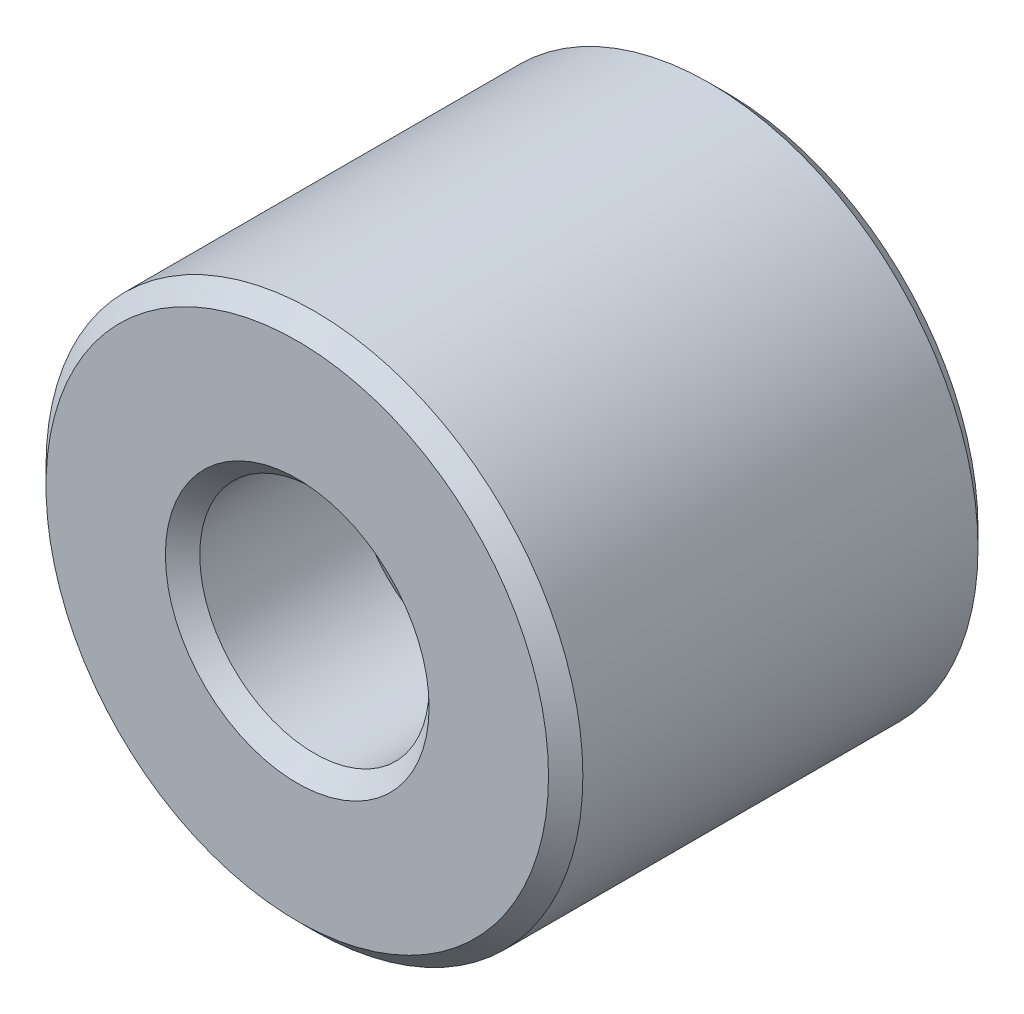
ISO-10303-21;
HEADER;
FILE_DESCRIPTION(('STEP AP214'),'2;1');
FILE_NAME('part.step','',(''),(''),'','','');
FILE_SCHEMA(('AUTOMOTIVE_DESIGN { 1 0 10303 214 1 1 1 1 }'));
ENDSEC;
DATA;
#1=APPLICATION_CONTEXT('core data for automotive mechanical design processes');
#2=APPLICATION_PROTOCOL_DEFINITION('international standard','automotive_design',2000,#1);
#3=PRODUCT_CONTEXT('',#1,'mechanical');
#4=PRODUCT('Part','Part','',(#3));
#5=PRODUCT_RELATED_PRODUCT_CATEGORY('part','',(#4));
#6=PRODUCT_DEFINITION_FORMATION('','',#4);
#7=PRODUCT_DEFINITION_CONTEXT('part definition',#1,'design');
#8=PRODUCT_DEFINITION('design','',#6,#7);
#9=PRODUCT_DEFINITION_SHAPE('','',#8);
#10=(LENGTH_UNIT() NAMED_UNIT(*) SI_UNIT(.MILLI.,.METRE.));
#11=(NAMED_UNIT(*) PLANE_ANGLE_UNIT() SI_UNIT($,.RADIAN.));
#12=(NAMED_UNIT(*) SI_UNIT($,.STERADIAN.) SOLID_ANGLE_UNIT());
#13=UNCERTAINTY_MEASURE_WITH_UNIT(LENGTH_MEASURE(1.E-05),#10,'distance_accuracy_value','');
#14=(GEOMETRIC_REPRESENTATION_CONTEXT(3) GLOBAL_UNCERTAINTY_ASSIGNED_CONTEXT((#13)) GLOBAL_UNIT_ASSIGNED_CONTEXT((#10,
#11,#12)) REPRESENTATION_CONTEXT('',''));
#15=CARTESIAN_POINT('',(0.,0.,0.));
#16=DIRECTION('',(0.,0.,1.));
#17=DIRECTION('',(1.,0.,0.));
#18=AXIS2_PLACEMENT_3D('',#15,#16,#17);
#19=CARTESIAN_POINT('',(0.,4.9022,-2.413));
#20=DIRECTION('',(0.,0.,1.));
#21=DIRECTION('',(0.,1.,0.));
#22=AXIS2_PLACEMENT_3D('',#19,#20,#21);
#23=PLANE('',#22);
#24=CARTESIAN_POINT('',(0.,0.,-2.413));
#25=DIRECTION('',(0.,0.,-1.));
#26=DIRECTION('',(-1.,0.,0.));
#27=AXIS2_PLACEMENT_3D('',#24,#25,#26);
#28=CIRCLE('',#27,3.8989);
#29=CARTESIAN_POINT('',(-3.89890000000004,0.,-2.41300000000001));
#30=VERTEX_POINT('',#29);
#31=EDGE_CURVE('E165',#30,#30,#28,.T.);
#32=ORIENTED_EDGE('',*,*,#31,.F.);
#33=EDGE_LOOP('',(#32));
#34=FACE_BOUND('',#33,.T.);
#35=CARTESIAN_POINT('',(0.,0.,-2.413));
#36=DIRECTION('',(0.,0.,-1.));
#37=DIRECTION('',(-1.,0.,0.));
#38=AXIS2_PLACEMENT_3D('',#35,#36,#37);
#39=CIRCLE('',#38,4.9022);
#40=CARTESIAN_POINT('',(-4.90220000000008,0.,-2.41300000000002));
#41=VERTEX_POINT('',#40);
#42=EDGE_CURVE('E151',#41,#41,#39,.T.);
#43=ORIENTED_EDGE('',*,*,#42,.T.);
#44=EDGE_LOOP('',(#43));
#45=FACE_BOUND('',#44,.T.);
#46=ADVANCED_FACE('F56',(#34,#45),#23,.F.);
#47=CARTESIAN_POINT('',(0.,7.42950000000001,-9.525));
#48=DIRECTION('',(0.,0.,1.));
#49=DIRECTION('',(0.,1.,0.));
#50=AXIS2_PLACEMENT_3D('',#47,#48,#49);
#51=PLANE('',#50);
#52=CARTESIAN_POINT('',(0.,0.,-9.525));
#53=DIRECTION('',(0.,0.,-1.));
#54=DIRECTION('',(-1.,0.,0.));
#55=AXIS2_PLACEMENT_3D('',#52,#53,#54);
#56=CIRCLE('',#55,5.6642);
#57=CARTESIAN_POINT('',(-5.66420000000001,0.,-9.52500000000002));
#58=VERTEX_POINT('',#57);
#59=EDGE_CURVE('E144',#58,#58,#56,.T.);
#60=ORIENTED_EDGE('',*,*,#59,.F.);
#61=EDGE_LOOP('',(#60));
#62=FACE_BOUND('',#61,.T.);
#63=CARTESIAN_POINT('',(0.,0.,-9.525));
#64=DIRECTION('',(0.,0.,-1.));
#65=DIRECTION('',(-1.,0.,0.));
#66=AXIS2_PLACEMENT_3D('',#63,#64,#65);
#67=CIRCLE('',#66,7.4295);
#68=CARTESIAN_POINT('',(7.4295000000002,0.,-9.52499999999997));
#69=VERTEX_POINT('',#68);
#70=EDGE_CURVE('E118',#69,#69,#67,.T.);
#71=ORIENTED_EDGE('',*,*,#70,.T.);
#72=EDGE_LOOP('',(#71));
#73=FACE_BOUND('',#72,.T.);
#74=ADVANCED_FACE('F195',(#62,#73),#51,.F.);
#75=CARTESIAN_POINT('',(0.,3.89890000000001,3.175));
#76=DIRECTION('',(0.,0.,-1.));
#77=DIRECTION('',(-1.,0.,0.));
#78=AXIS2_PLACEMENT_3D('',#75,#76,#77);
#79=PLANE('',#78);
#80=CARTESIAN_POINT('',(0.,0.,3.175));
#81=DIRECTION('',(0.,0.,-1.));
#82=DIRECTION('',(-1.,0.,0.));
#83=AXIS2_PLACEMENT_3D('',#80,#81,#82);
#84=CIRCLE('',#83,3.8989);
#85=CARTESIAN_POINT('',(3.89890000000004,0.,3.17500000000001));
#86=VERTEX_POINT('',#85);
#87=EDGE_CURVE('E12',#86,#86,#84,.T.);
#88=ORIENTED_EDGE('',*,*,#87,.T.);
#89=EDGE_LOOP('',(#88));
#90=FACE_BOUND('',#89,.T.);
#91=CARTESIAN_POINT('',(0.,0.,3.175));
#92=DIRECTION('',(0.,0.,-1.));
#93=DIRECTION('',(-1.,0.,0.));
#94=AXIS2_PLACEMENT_3D('',#91,#92,#93);
#95=CIRCLE('',#94,7.4295);
#96=CARTESIAN_POINT('',(7.42949999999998,0.,3.17500000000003));
#97=VERTEX_POINT('',#96);
#98=EDGE_CURVE('E67',#97,#97,#95,.T.);
#99=ORIENTED_EDGE('',*,*,#98,.F.);
#100=EDGE_LOOP('',(#99));
#101=FACE_BOUND('',#100,.T.);
#102=ADVANCED_FACE('F201',(#90,#101),#79,.F.);
#103=CARTESIAN_POINT('',(0.,0.,2.667));
#104=DIRECTION('',(0.,0.,1.));
#105=DIRECTION('',(1.,0.,0.));
#106=AXIS2_PLACEMENT_3D('',#103,#104,#105);
#107=CONICAL_SURFACE('',#106,3.3909,0.785398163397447);
#108=ORIENTED_EDGE('',*,*,#87,.F.);
#109=EDGE_LOOP('',(#108));
#110=FACE_BOUND('',#109,.T.);
#111=CARTESIAN_POINT('',(0.,0.,2.667));
#112=DIRECTION('',(0.,0.,-1.));
#113=DIRECTION('',(-1.,0.,0.));
#114=AXIS2_PLACEMENT_3D('',#111,#112,#113);
#115=CIRCLE('',#114,3.3909);
#116=CARTESIAN_POINT('',(-3.39089999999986,0.,2.66699999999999));
#117=VERTEX_POINT('',#116);
#118=EDGE_CURVE('E90',#117,#117,#115,.T.);
#119=ORIENTED_EDGE('',*,*,#118,.T.);
#120=EDGE_LOOP('',(#119));
#121=FACE_BOUND('',#120,.T.);
#122=ADVANCED_FACE('F220',(#110,#121),#107,.F.);
#123=CARTESIAN_POINT('',(0.,0.,3.175));
#124=DIRECTION('',(0.,0.,-1.));
#125=DIRECTION('',(-1.,0.,0.));
#126=AXIS2_PLACEMENT_3D('',#123,#124,#125);
#127=CONICAL_SURFACE('',#126,7.4295,0.785398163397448);
#128=CARTESIAN_POINT('',(0.,0.,2.667));
#129=DIRECTION('',(0.,0.,-1.));
#130=DIRECTION('',(-1.,0.,0.));
#131=AXIS2_PLACEMENT_3D('',#128,#129,#130);
#132=CIRCLE('',#131,7.9375);
#133=CARTESIAN_POINT('',(7.93750000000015,0.,2.66700000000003));
#134=VERTEX_POINT('',#133);
#135=EDGE_CURVE('E60',#134,#134,#132,.T.);
#136=ORIENTED_EDGE('',*,*,#135,.F.);
#137=EDGE_LOOP('',(#136));
#138=FACE_BOUND('',#137,.T.);
#139=ORIENTED_EDGE('',*,*,#98,.T.);
#140=EDGE_LOOP('',(#139));
#141=FACE_BOUND('',#140,.T.);
#142=ADVANCED_FACE('F58',(#138,#141),#127,.T.);
#143=CARTESIAN_POINT('',(0.,0.,-16.0333864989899));
#144=DIRECTION('',(0.,0.,-1.));
#145=DIRECTION('',(-1.,0.,0.));
#146=AXIS2_PLACEMENT_3D('',#143,#144,#145);
#147=CYLINDRICAL_SURFACE('',#146,7.9375);
#148=CARTESIAN_POINT('',(0.,0.,-9.017));
#149=DIRECTION('',(0.,0.,-1.));
#150=DIRECTION('',(-1.,0.,0.));
#151=AXIS2_PLACEMENT_3D('',#148,#149,#150);
#152=CIRCLE('',#151,7.9375);
#153=CARTESIAN_POINT('',(7.93750000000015,0.,-9.01699999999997));
#154=VERTEX_POINT('',#153);
#155=EDGE_CURVE('E127',#154,#154,#152,.T.);
#156=ORIENTED_EDGE('',*,*,#155,.F.);
#157=EDGE_LOOP('',(#156));
#158=FACE_BOUND('',#157,.T.);
#159=ORIENTED_EDGE('',*,*,#135,.T.);
#160=EDGE_LOOP('',(#159));
#161=FACE_BOUND('',#160,.T.);
#162=ADVANCED_FACE('F205',(#158,#161),#147,.T.);
#163=CARTESIAN_POINT('',(0.,0.,-9.017));
#164=DIRECTION('',(0.,0.,1.));
#165=DIRECTION('',(1.,0.,0.));
#166=AXIS2_PLACEMENT_3D('',#163,#164,#165);
#167=CONICAL_SURFACE('',#166,7.9375,0.78539816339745);
#168=ORIENTED_EDGE('',*,*,#155,.T.);
#169=EDGE_LOOP('',(#168));
#170=FACE_BOUND('',#169,.T.);
#171=ORIENTED_EDGE('',*,*,#70,.F.);
#172=EDGE_LOOP('',(#171));
#173=FACE_BOUND('',#172,.T.);
#174=ADVANCED_FACE('F207',(#170,#173),#167,.T.);
#175=CARTESIAN_POINT('',(0.,0.,-9.525));
#176=DIRECTION('',(0.,0.,-1.));
#177=DIRECTION('',(-1.,0.,0.));
#178=AXIS2_PLACEMENT_3D('',#175,#176,#177);
#179=CONICAL_SURFACE('',#178,5.6642,0.78539816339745);
#180=ORIENTED_EDGE('',*,*,#59,.T.);
#181=EDGE_LOOP('',(#180));
#182=FACE_BOUND('',#181,.T.);
#183=CARTESIAN_POINT('',(0.,0.,-9.017));
#184=DIRECTION('',(0.,0.,-1.));
#185=DIRECTION('',(-1.,0.,0.));
#186=AXIS2_PLACEMENT_3D('',#183,#184,#185);
#187=CIRCLE('',#186,5.1562);
#188=CARTESIAN_POINT('',(-5.15620000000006,0.,-9.01700000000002));
#189=VERTEX_POINT('',#188);
#190=EDGE_CURVE('E139',#189,#189,#187,.T.);
#191=ORIENTED_EDGE('',*,*,#190,.F.);
#192=EDGE_LOOP('',(#191));
#193=FACE_BOUND('',#192,.T.);
#194=ADVANCED_FACE('F190',(#182,#193),#179,.F.);
#195=CARTESIAN_POINT('',(0.,0.,-16.0333864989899));
#196=DIRECTION('',(0.,0.,-1.));
#197=DIRECTION('',(-1.,0.,0.));
#198=AXIS2_PLACEMENT_3D('',#195,#196,#197);
#199=CYLINDRICAL_SURFACE('',#198,5.1562);
#200=ORIENTED_EDGE('',*,*,#190,.T.);
#201=EDGE_LOOP('',(#200));
#202=FACE_BOUND('',#201,.T.);
#203=CARTESIAN_POINT('',(0.,0.,-2.667));
#204=DIRECTION('',(0.,0.,-1.));
#205=DIRECTION('',(-1.,0.,0.));
#206=AXIS2_PLACEMENT_3D('',#203,#204,#205);
#207=CIRCLE('',#206,5.1562);
#208=CARTESIAN_POINT('',(-5.15620000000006,0.,-2.66700000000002));
#209=VERTEX_POINT('',#208);
#210=EDGE_CURVE('E134',#209,#209,#207,.T.);
#211=ORIENTED_EDGE('',*,*,#210,.F.);
#212=EDGE_LOOP('',(#211));
#213=FACE_BOUND('',#212,.T.);
#214=ADVANCED_FACE('F140',(#202,#213),#199,.F.);
#215=CARTESIAN_POINT('',(0.,0.,-2.667));
#216=DIRECTION('',(0.,0.,-1.));
#217=DIRECTION('',(-1.,0.,0.));
#218=AXIS2_PLACEMENT_3D('',#215,#216,#217);
#219=TOROIDAL_SURFACE('',#218,4.9022,0.254);
#220=ORIENTED_EDGE('',*,*,#210,.T.);
#221=EDGE_LOOP('',(#220));
#222=FACE_BOUND('',#221,.T.);
#223=ORIENTED_EDGE('',*,*,#42,.F.);
#224=EDGE_LOOP('',(#223));
#225=FACE_BOUND('',#224,.T.);
#226=ADVANCED_FACE('F180',(#222,#225),#219,.F.);
#227=CARTESIAN_POINT('',(0.,0.,-2.413));
#228=DIRECTION('',(0.,0.,-1.));
#229=DIRECTION('',(-1.,0.,0.));
#230=AXIS2_PLACEMENT_3D('',#227,#228,#229);
#231=CONICAL_SURFACE('',#230,3.8989,0.785398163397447);
#232=ORIENTED_EDGE('',*,*,#31,.T.);
#233=EDGE_LOOP('',(#232));
#234=FACE_BOUND('',#233,.T.);
#235=CARTESIAN_POINT('',(0.,0.,-1.905));
#236=DIRECTION('',(0.,0.,-1.));
#237=DIRECTION('',(-1.,0.,0.));
#238=AXIS2_PLACEMENT_3D('',#235,#236,#237);
#239=CIRCLE('',#238,3.3909);
#240=CARTESIAN_POINT('',(-3.39089999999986,0.,-1.90500000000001));
#241=VERTEX_POINT('',#240);
#242=EDGE_CURVE('E99',#241,#241,#239,.T.);
#243=ORIENTED_EDGE('',*,*,#242,.F.);
#244=EDGE_LOOP('',(#243));
#245=FACE_BOUND('',#244,.T.);
#246=ADVANCED_FACE('F182',(#234,#245),#231,.F.);
#247=CARTESIAN_POINT('',(0.,0.,-16.0333864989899));
#248=DIRECTION('',(0.,0.,-1.));
#249=DIRECTION('',(-1.,0.,0.));
#250=AXIS2_PLACEMENT_3D('',#247,#248,#249);
#251=CYLINDRICAL_SURFACE('',#250,3.3909);
#252=ORIENTED_EDGE('',*,*,#242,.T.);
#253=EDGE_LOOP('',(#252));
#254=FACE_BOUND('',#253,.T.);
#255=ORIENTED_EDGE('',*,*,#118,.F.);
#256=EDGE_LOOP('',(#255));
#257=FACE_BOUND('',#256,.T.);
#258=ADVANCED_FACE('F188',(#254,#257),#251,.F.);
#259=CLOSED_SHELL('',(#46,#74,#102,#122,#142,#162,#174,#194,#214,#226,#246,#258));
#260=MANIFOLD_SOLID_BREP('B2',#259);
#261=ADVANCED_BREP_SHAPE_REPRESENTATION('',(#18,#260),#14);
#262=SHAPE_DEFINITION_REPRESENTATION(#9,#261);
ENDSEC;
END-ISO-10303-21;
